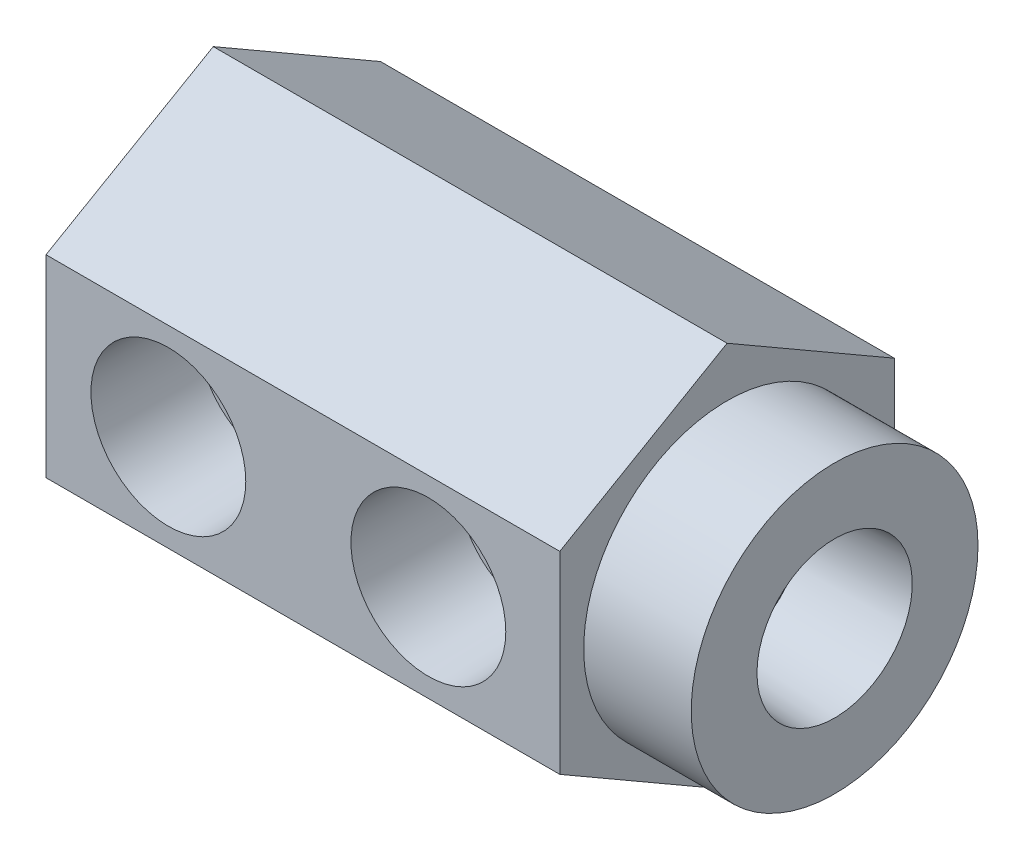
from build123d import *

# Parameters (mm, degrees)
BOSS_EXTRUDE1_DEPTH                = 34.13125
SKETCH2_R                          = 9.525
BOSS_EXTRUDE2_DEPTH                = 41.275
F_1_8_NPT_TAPPED_HOLE2_AT_2_COUNT  = 2
F_1_8_NPT_TAPPED_HOLE2_AT_2_PITCH  = 17.272
F_21_0_159_DIAMETER_HOLE1_D        = 4.0386
F_21_0_159_DIAMETER_HOLE1_DEPTH    = 31.75
F_21_0_159_DIAMETER_HOLE1_TIP      = 1.213317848
F_3_16_0_1875_DIAMETER_HOLE1_D     = 4.7625
F_3_16_0_1875_DIAMETER_HOLE1_DEPTH = 22.225
F_3_16_0_1875_DIAMETER_HOLE1_TIP   = 1.430799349


with BuildPart() as part:
    # Sketch1 → Boss-Extrude1 (new body)
    with BuildSketch(Plane(origin=(0, 0, 0), x_dir=(0, 0, -1), z_dir=(1, 0, 0))):
        Polygon((-11.1125, 6.415804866), (-11.1125, -6.415804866), (0, -12.831609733), (11.1125, -6.415804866), (11.1125, 6.415804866), (0, 12.831609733), align=None)
    extrude(amount=BOSS_EXTRUDE1_DEPTH)

    # Sketch2 → Boss-Extrude2 (add)
    with BuildSketch(Plane(origin=(0, 0, 0), x_dir=(0, 0, -1), z_dir=(1, 0, 0))):
        Circle(SKETCH2_R)
    extrude(amount=BOSS_EXTRUDE2_DEPTH)

    # Sketch4 → Cut-Revolve1 (revolve, cut)
    with BuildSketch(Plane(origin=(0, 0, 0), x_dir=(1, 0, 0), z_dir=(0, 1, 0)), mode=Mode.PRIVATE) as cut_revolve1_sk:
        Polygon((25.4, 0), (25.4, 4.3688), (34.29, 4.3688), (34.29, 4.792793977), (41.275, 5.158862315), (41.275, 0), align=None)
    revolve(cut_revolve1_sk.sketch.rotate(Axis((-4.011919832, 0, 0), (1, 0, 0)), 180), axis=Axis((-4.011919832, 0, 0), (1, 0, 0)), mode=Mode.SUBTRACT)

    # Sketch5 → 1_8 NPT Tapped Hole1 (revolve, cut)
    with BuildSketch(Plane(origin=(8.128, 0, -11.1125), x_dir=(0, 1, 0), z_dir=(1, 0, 0))):
        Polygon((0, 0), (0, 18.408468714), (4.2164, 15.875), (4.2164, 6.92404), (5.10912087, 6.92404), (5.3164359, 0), align=None)
    revolve(axis=Axis((8.128, 0, -17.4625), (0, 0, 1)), mode=Mode.SUBTRACT)

    # Sketch7 → 1_8 NPT Tapped Hole2 (revolve, cut)
    with BuildSketch(Plane(origin=(8.128, 0, 11.1125), x_dir=(0, -1, 0), z_dir=(1, 0, 0))):
        Polygon((0, 0), (0, 18.408468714), (4.2164, 15.875), (4.2164, 6.92404), (4.93618497, 6.92404), (5.1435, 0), align=None)
    f_1_8_npt_tapped_hole2 = revolve(axis=Axis((8.128, 0, 17.4625), (0, 0, -1)), mode=Mode.SUBTRACT)

    # 1_8 NPT Tapped Hole2 at 2: 1_8 NPT Tapped Hole2 ×2
    with Locations(*[(i * F_1_8_NPT_TAPPED_HOLE2_AT_2_PITCH, 0, 0) for i in range(1, F_1_8_NPT_TAPPED_HOLE2_AT_2_COUNT)]):
        add(f_1_8_npt_tapped_hole2, mode=Mode.SUBTRACT)

    # 21 _0.159_ Diameter Hole1
    with Locations(Plane(origin=(41.275, 0, 0), x_dir=(0, 0, -1), z_dir=(1, 0, 0))):
        with Locations((0, 0)):
            Hole(F_21_0_159_DIAMETER_HOLE1_D / 2, depth=F_21_0_159_DIAMETER_HOLE1_DEPTH)
            with Locations((0, 0, -(F_21_0_159_DIAMETER_HOLE1_DEPTH + F_21_0_159_DIAMETER_HOLE1_TIP / 2))):  # 118° drill point
                Cone(0, F_21_0_159_DIAMETER_HOLE1_D / 2, F_21_0_159_DIAMETER_HOLE1_TIP, mode=Mode.SUBTRACT)

    # 3_16 _0.1875_ Diameter Hole1
    with Locations(Plane(origin=(41.275, 0, 0), x_dir=(0, 0, -1), z_dir=(1, 0, 0))):
        with Locations((0, 0)):
            Hole(F_3_16_0_1875_DIAMETER_HOLE1_D / 2, depth=F_3_16_0_1875_DIAMETER_HOLE1_DEPTH)
            with Locations((0, 0, -(F_3_16_0_1875_DIAMETER_HOLE1_DEPTH + F_3_16_0_1875_DIAMETER_HOLE1_TIP / 2))):  # 118° drill point
                Cone(0, F_3_16_0_1875_DIAMETER_HOLE1_D / 2, F_3_16_0_1875_DIAMETER_HOLE1_TIP, mode=Mode.SUBTRACT)


solid = part.part
